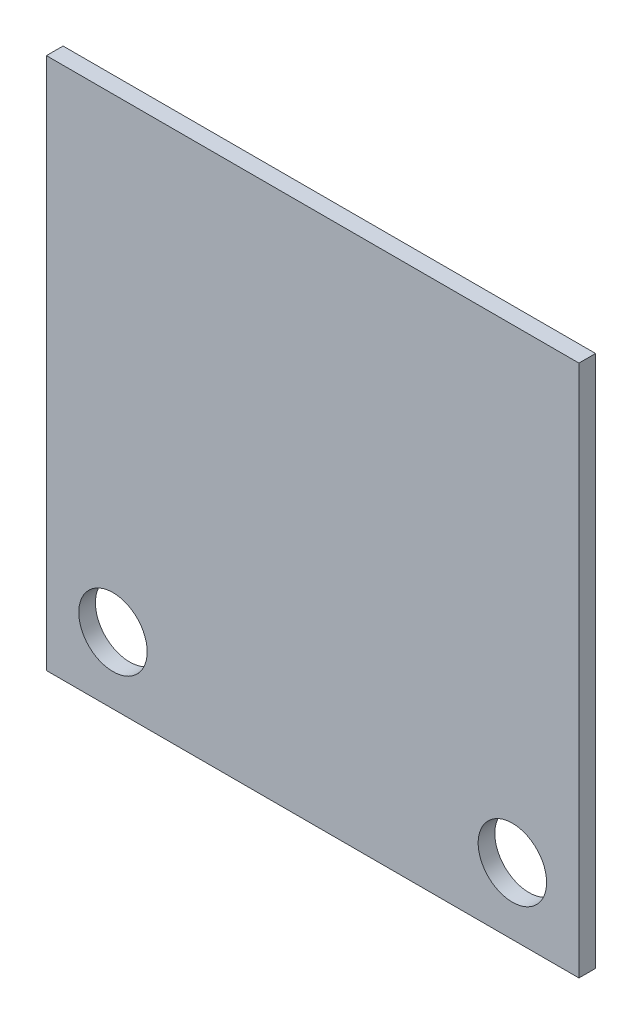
from build123d import *

# Parameters (mm, degrees)
SKETCH1_W                      = 25.4
SKETCH1_H                      = 25.4
EXTRUDE1_DEPTH                 = 0.79375
F_30_0_128500_DIAMETER_HOLE1_D = 3.2639


with BuildPart() as part:
    # Sketch1 → Extrude1 (new body)
    with BuildSketch(Plane.XY):
        with Locations((0, 12.7)):
            Rectangle(SKETCH1_W, SKETCH1_H)
    extrude(amount=EXTRUDE1_DEPTH)

    # 30 _0.128500_ Diameter Hole1 (through all)
    with Locations(Plane(origin=(-9.525, 3.175, 0.79375), x_dir=(1, 0, 0), z_dir=(0, 0, 1))):
        with Locations((0, 0), (19.05, 0)):
            Hole(F_30_0_128500_DIAMETER_HOLE1_D / 2)


solid = part.part
